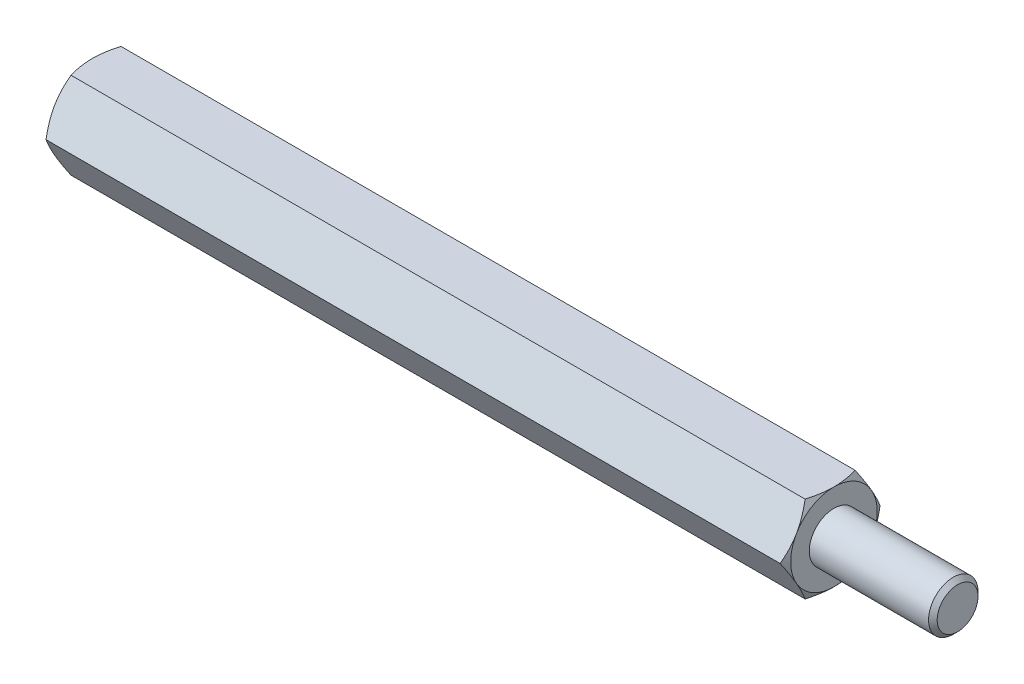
ISO-10303-21;
HEADER;
FILE_DESCRIPTION(('STEP AP214'),'2;1');
FILE_NAME('part.step','',(''),(''),'','','');
FILE_SCHEMA(('AUTOMOTIVE_DESIGN { 1 0 10303 214 1 1 1 1 }'));
ENDSEC;
DATA;
#1=APPLICATION_CONTEXT('core data for automotive mechanical design processes');
#2=APPLICATION_PROTOCOL_DEFINITION('international standard','automotive_design',2000,#1);
#3=PRODUCT_CONTEXT('',#1,'mechanical');
#4=PRODUCT('Part','Part','',(#3));
#5=PRODUCT_RELATED_PRODUCT_CATEGORY('part','',(#4));
#6=PRODUCT_DEFINITION_FORMATION('','',#4);
#7=PRODUCT_DEFINITION_CONTEXT('part definition',#1,'design');
#8=PRODUCT_DEFINITION('design','',#6,#7);
#9=PRODUCT_DEFINITION_SHAPE('','',#8);
#10=(LENGTH_UNIT() NAMED_UNIT(*) SI_UNIT(.MILLI.,.METRE.));
#11=(NAMED_UNIT(*) PLANE_ANGLE_UNIT() SI_UNIT($,.RADIAN.));
#12=(NAMED_UNIT(*) SI_UNIT($,.STERADIAN.) SOLID_ANGLE_UNIT());
#13=UNCERTAINTY_MEASURE_WITH_UNIT(LENGTH_MEASURE(1.E-05),#10,'distance_accuracy_value','');
#14=(GEOMETRIC_REPRESENTATION_CONTEXT(3) GLOBAL_UNCERTAINTY_ASSIGNED_CONTEXT((#13)) GLOBAL_UNIT_ASSIGNED_CONTEXT((#10,
#11,#12)) REPRESENTATION_CONTEXT('',''));
#15=CARTESIAN_POINT('',(0.,0.,0.));
#16=DIRECTION('',(0.,0.,1.));
#17=DIRECTION('',(1.,0.,0.));
#18=AXIS2_PLACEMENT_3D('',#15,#16,#17);
#19=CARTESIAN_POINT('',(30.,3.5,-2.02072594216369));
#20=DIRECTION('',(1.,0.,0.));
#21=DIRECTION('',(0.,0.,-1.));
#22=AXIS2_PLACEMENT_3D('',#19,#20,#21);
#23=PLANE('',#22);
#24=CARTESIAN_POINT('',(30.,0.,0.));
#25=DIRECTION('',(1.,0.,0.));
#26=DIRECTION('',(0.,0.,-1.));
#27=AXIS2_PLACEMENT_3D('',#24,#25,#26);
#28=CIRCLE('',#27,3.50000000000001);
#29=CARTESIAN_POINT('',(30.,-1.75,-3.03108891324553));
#30=VERTEX_POINT('',#29);
#31=CARTESIAN_POINT('',(30.,1.75,-3.03108891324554));
#32=VERTEX_POINT('',#31);
#33=EDGE_CURVE('E288',#30,#32,#28,.T.);
#34=ORIENTED_EDGE('',*,*,#33,.T.);
#35=CARTESIAN_POINT('',(30.,3.5,0.));
#36=VERTEX_POINT('',#35);
#37=EDGE_CURVE('E53',#32,#36,#28,.T.);
#38=ORIENTED_EDGE('',*,*,#37,.T.);
#39=CARTESIAN_POINT('',(30.,1.75,3.03108891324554));
#40=VERTEX_POINT('',#39);
#41=EDGE_CURVE('E297',#36,#40,#28,.T.);
#42=ORIENTED_EDGE('',*,*,#41,.T.);
#43=CARTESIAN_POINT('',(30.,-1.75000000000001,3.03108891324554));
#44=VERTEX_POINT('',#43);
#45=EDGE_CURVE('E302',#40,#44,#28,.T.);
#46=ORIENTED_EDGE('',*,*,#45,.T.);
#47=CARTESIAN_POINT('',(30.,0.,0.));
#48=DIRECTION('',(-1.,0.,0.));
#49=DIRECTION('',(0.,-1.,0.));
#50=AXIS2_PLACEMENT_3D('',#47,#48,#49);
#51=CIRCLE('',#50,3.50000000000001);
#52=CARTESIAN_POINT('',(30.,-3.50000000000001,0.));
#53=VERTEX_POINT('',#52);
#54=EDGE_CURVE('E193',#53,#44,#51,.T.);
#55=ORIENTED_EDGE('',*,*,#54,.F.);
#56=EDGE_CURVE('E61',#53,#30,#28,.T.);
#57=ORIENTED_EDGE('',*,*,#56,.T.);
#58=EDGE_LOOP('',(#34,#38,#42,#46,#55,#57));
#59=FACE_BOUND('',#58,.T.);
#60=CARTESIAN_POINT('',(30.,0.,0.));
#61=DIRECTION('',(1.,0.,0.));
#62=DIRECTION('',(0.,0.,-1.));
#63=AXIS2_PLACEMENT_3D('',#60,#61,#62);
#64=CIRCLE('',#63,2.);
#65=CARTESIAN_POINT('',(30.,0.,-2.));
#66=VERTEX_POINT('',#65);
#67=EDGE_CURVE('E315',#66,#66,#64,.T.);
#68=ORIENTED_EDGE('',*,*,#67,.F.);
#69=EDGE_LOOP('',(#68));
#70=FACE_BOUND('',#69,.T.);
#71=ADVANCED_FACE('F37',(#59,#70),#23,.T.);
#72=CARTESIAN_POINT('',(30.,0.,-4.04145188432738));
#73=DIRECTION('',(0.,-0.5,0.866025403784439));
#74=DIRECTION('',(0.,-0.866025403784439,-0.5));
#75=AXIS2_PLACEMENT_3D('',#72,#73,#74);
#76=PLANE('',#75);
#77=CARTESIAN_POINT('',(29.6873259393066,-0.000200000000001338,-4.04156735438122));
#78=CARTESIAN_POINT('',(29.73861421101,0.153607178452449,-3.9527667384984));
#79=CARTESIAN_POINT('',(29.7852590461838,0.308742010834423,-3.86319960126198));
#80=CARTESIAN_POINT('',(29.8666781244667,0.621698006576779,-3.68251437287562));
#81=CARTESIAN_POINT('',(29.9014235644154,0.779524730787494,-3.59139307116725));
#82=CARTESIAN_POINT('',(29.9555099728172,1.09322221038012,-3.41027974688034));
#83=CARTESIAN_POINT('',(29.9752109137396,1.24904469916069,-3.32031559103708));
#84=CARTESIAN_POINT('',(29.9987298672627,1.56142288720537,-3.13996396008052));
#85=CARTESIAN_POINT('',(30.0025673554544,1.71797745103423,-3.04957714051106));
#86=CARTESIAN_POINT('',(29.994584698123,2.01050921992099,-2.88068384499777));
#87=CARTESIAN_POINT('',(29.9847245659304,2.1465302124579,-2.80215208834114));
#88=CARTESIAN_POINT('',(29.9534735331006,2.41768602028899,-2.64560020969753));
#89=CARTESIAN_POINT('',(29.9320719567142,2.55281989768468,-2.5675806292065));
#90=CARTESIAN_POINT('',(29.8785695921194,2.82453479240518,-2.41070596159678));
#91=CARTESIAN_POINT('',(29.8462420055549,2.96108141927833,-2.33187072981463));
#92=CARTESIAN_POINT('',(29.772871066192,3.2321380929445,-2.17537608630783));
#93=CARTESIAN_POINT('',(29.7318449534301,3.36665161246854,-2.09771466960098));
#94=CARTESIAN_POINT('',(29.6873259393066,3.5002,-2.02061047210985));
#95=B_SPLINE_CURVE_WITH_KNOTS('',3,(#77,#78,#79,#80,#81,#82,#83,#84,#85,#86,#87,#88,#89,#90,#91,
#92,#93,#94),.UNSPECIFIED.,.F.,.F.,(4,2,2,2,2,2,2,2,4),(0.,0.554793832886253,1.11092123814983,
1.65328467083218,2.19498204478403,2.6666513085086,3.13875761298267,3.6213361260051,
4.10296698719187),.UNSPECIFIED.);
#96=CARTESIAN_POINT('',(29.6873926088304,0.,-4.04145188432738));
#97=VERTEX_POINT('',#96);
#98=EDGE_CURVE('E323',#97,#32,#95,.T.);
#99=ORIENTED_EDGE('',*,*,#98,.F.);
#100=DIRECTION('',(-1.,0.,0.));
#101=VECTOR('',#100,1.);
#102=CARTESIAN_POINT('',(30.,0.,-4.04145188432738));
#103=LINE('',#102,#101);
#104=CARTESIAN_POINT('',(-29.6873926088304,0.,-4.04145188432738));
#105=VERTEX_POINT('',#104);
#106=EDGE_CURVE('E264',#97,#105,#103,.T.);
#107=ORIENTED_EDGE('',*,*,#106,.T.);
#108=CARTESIAN_POINT('',(-29.6873259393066,3.5002,-2.02061047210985));
#109=CARTESIAN_POINT('',(-29.73861421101,3.34639282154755,-2.10941108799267));
#110=CARTESIAN_POINT('',(-29.7852590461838,3.19125798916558,-2.19897822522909));
#111=CARTESIAN_POINT('',(-29.8666781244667,2.87830199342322,-2.37966345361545));
#112=CARTESIAN_POINT('',(-29.9014235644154,2.7204752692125,-2.47078475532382));
#113=CARTESIAN_POINT('',(-29.9555099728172,2.40677778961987,-2.65189807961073));
#114=CARTESIAN_POINT('',(-29.9752109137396,2.25095530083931,-2.74186223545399));
#115=CARTESIAN_POINT('',(-29.9987298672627,1.93857711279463,-2.92221386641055));
#116=CARTESIAN_POINT('',(-30.0025673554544,1.78202254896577,-3.01260068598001));
#117=CARTESIAN_POINT('',(-29.994584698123,1.48949078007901,-3.1814939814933));
#118=CARTESIAN_POINT('',(-29.9847245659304,1.35346978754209,-3.26002573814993));
#119=CARTESIAN_POINT('',(-29.9534735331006,1.082313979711,-3.41657761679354));
#120=CARTESIAN_POINT('',(-29.9320719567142,0.947180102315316,-3.49459719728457));
#121=CARTESIAN_POINT('',(-29.8785695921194,0.675465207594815,-3.65147186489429));
#122=CARTESIAN_POINT('',(-29.8462420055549,0.538918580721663,-3.73030709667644));
#123=CARTESIAN_POINT('',(-29.772871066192,0.267861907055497,-3.88680174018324));
#124=CARTESIAN_POINT('',(-29.7318449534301,0.133348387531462,-3.96446315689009));
#125=CARTESIAN_POINT('',(-29.6873259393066,-0.000200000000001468,-4.04156735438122));
#126=B_SPLINE_CURVE_WITH_KNOTS('',3,(#108,#109,#110,#111,#112,#113,#114,#115,#116,#117,#118,
#119,#120,#121,#122,#123,#124,#125),.UNSPECIFIED.,.F.,.F.,(4,2,2,2,2,2,2,2,4),(0.,
0.554793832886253,1.11092123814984,1.65328467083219,2.19498204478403,2.6666513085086,
3.13875761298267,3.6213361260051,4.10296698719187),.UNSPECIFIED.);
#127=CARTESIAN_POINT('',(-30.,1.75,-3.03108891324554));
#128=VERTEX_POINT('',#127);
#129=EDGE_CURVE('E417',#128,#105,#126,.T.);
#130=ORIENTED_EDGE('',*,*,#129,.F.);
#131=CARTESIAN_POINT('',(-29.6873926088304,3.5,-2.02072594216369));
#132=VERTEX_POINT('',#131);
#133=EDGE_CURVE('E416',#132,#128,#126,.T.);
#134=ORIENTED_EDGE('',*,*,#133,.F.);
#135=DIRECTION('',(-1.,0.,0.));
#136=VECTOR('',#135,1.);
#137=CARTESIAN_POINT('',(30.,3.5,-2.02072594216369));
#138=LINE('',#137,#136);
#139=CARTESIAN_POINT('',(29.6873926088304,3.5,-2.02072594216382));
#140=VERTEX_POINT('',#139);
#141=EDGE_CURVE('E279',#140,#132,#138,.T.);
#142=ORIENTED_EDGE('',*,*,#141,.F.);
#143=EDGE_CURVE('E229',#32,#140,#95,.T.);
#144=ORIENTED_EDGE('',*,*,#143,.F.);
#145=EDGE_LOOP('',(#99,#107,#130,#134,#142,#144));
#146=FACE_BOUND('',#145,.T.);
#147=ADVANCED_FACE('F148',(#146),#76,.F.);
#148=CARTESIAN_POINT('',(30.,3.5,-2.02072594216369));
#149=DIRECTION('',(0.,-1.,0.));
#150=DIRECTION('',(0.,0.,-1.));
#151=AXIS2_PLACEMENT_3D('',#148,#149,#150);
#152=PLANE('',#151);
#153=CARTESIAN_POINT('',(28.2443294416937,3.5,-5.525713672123));
#154=CARTESIAN_POINT('',(28.3192813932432,3.5,-5.3720019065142));
#155=CARTESIAN_POINT('',(28.3935424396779,3.5,-5.21794762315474));
#156=CARTESIAN_POINT('',(28.5402960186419,3.5,-4.90897223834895));
#157=CARTESIAN_POINT('',(28.6127882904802,3.5,-4.75405101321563));
#158=CARTESIAN_POINT('',(28.7559617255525,3.5,-4.44240758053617));
#159=CARTESIAN_POINT('',(28.8266316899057,3.5,-4.28568021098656));
#160=CARTESIAN_POINT('',(28.9652074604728,3.5,-3.97101270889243));
#161=CARTESIAN_POINT('',(29.0331133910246,3.5,-3.81307263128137));
#162=CARTESIAN_POINT('',(29.1677143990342,3.5,-3.49026114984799));
#163=CARTESIAN_POINT('',(29.2342871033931,3.5,-3.32533845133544));
#164=CARTESIAN_POINT('',(29.3626267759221,3.5,-2.99359992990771));
#165=CARTESIAN_POINT('',(29.4243932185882,3.5,-2.82678390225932));
#166=CARTESIAN_POINT('',(29.5415700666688,3.5,-2.49127529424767));
#167=CARTESIAN_POINT('',(29.5969925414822,3.5,-2.32258697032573));
#168=CARTESIAN_POINT('',(29.6997679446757,3.5,-1.98279215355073));
#169=CARTESIAN_POINT('',(29.7471233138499,3.5,-1.81168640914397));
#170=CARTESIAN_POINT('',(29.8312987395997,3.5,-1.46793354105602));
#171=CARTESIAN_POINT('',(29.8681796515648,3.5,-1.2953015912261));
#172=CARTESIAN_POINT('',(29.9293955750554,3.5,-0.947791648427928));
#173=CARTESIAN_POINT('',(29.953731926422,3.5,-0.772913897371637));
#174=CARTESIAN_POINT('',(29.9876038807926,3.5,-0.424108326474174));
#175=CARTESIAN_POINT('',(29.997337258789,3.5,-0.250200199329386));
#176=CARTESIAN_POINT('',(30.0017053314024,3.5,0.0978233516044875));
#177=CARTESIAN_POINT('',(29.9963399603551,3.5,0.271938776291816));
#178=CARTESIAN_POINT('',(29.9750118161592,3.5,0.564711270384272));
#179=CARTESIAN_POINT('',(29.9628919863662,3.5,0.683667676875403));
#180=CARTESIAN_POINT('',(29.9323080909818,3.5,0.920767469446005));
#181=CARTESIAN_POINT('',(29.9138432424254,3.5,1.03891075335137));
#182=CARTESIAN_POINT('',(29.8498956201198,3.5,1.39193174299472));
#183=CARTESIAN_POINT('',(29.7958695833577,3.5,1.62528232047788));
#184=CARTESIAN_POINT('',(29.7014515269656,3.5,1.97433825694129));
#185=CARTESIAN_POINT('',(29.6672900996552,3.5,2.09183268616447));
#186=CARTESIAN_POINT('',(29.595234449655,3.5,2.32568238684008));
#187=CARTESIAN_POINT('',(29.5573401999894,3.5,2.44203765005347));
#188=CARTESIAN_POINT('',(29.4784421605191,3.5,2.6736423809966));
#189=CARTESIAN_POINT('',(29.4374392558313,3.5,2.78889215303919));
#190=CARTESIAN_POINT('',(29.352824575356,3.5,3.01842460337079));
#191=CARTESIAN_POINT('',(29.3092128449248,3.5,3.1327072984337));
#192=CARTESIAN_POINT('',(29.1958241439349,3.5,3.42150510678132));
#193=CARTESIAN_POINT('',(29.1245636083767,3.5,3.59543696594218));
#194=CARTESIAN_POINT('',(28.9781026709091,3.5,3.94163961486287));
#195=CARTESIAN_POINT('',(28.9029019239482,3.5,4.11391025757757));
#196=CARTESIAN_POINT('',(28.7494252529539,3.5,4.45713072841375));
#197=CARTESIAN_POINT('',(28.6711484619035,3.5,4.62808016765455));
#198=CARTESIAN_POINT('',(28.512188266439,3.5,4.9688584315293));
#199=CARTESIAN_POINT('',(28.4315047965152,3.5,5.13868722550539));
#200=CARTESIAN_POINT('',(28.1863871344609,3.5,5.64726192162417));
#201=CARTESIAN_POINT('',(28.0190975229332,3.5,5.98463020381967));
#202=CARTESIAN_POINT('',(27.6795854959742,3.5,6.65678495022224));
#203=CARTESIAN_POINT('',(27.5073639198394,3.5,6.99157184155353));
#204=CARTESIAN_POINT('',(27.1760800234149,3.5,7.62749570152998));
#205=CARTESIAN_POINT('',(27.0173299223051,3.5,7.92879562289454));
#206=CARTESIAN_POINT('',(26.6977473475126,3.5,8.53030635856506));
#207=CARTESIAN_POINT('',(26.5369147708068,3.5,8.83051711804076));
#208=CARTESIAN_POINT('',(26.2141792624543,3.5,9.42918006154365));
#209=CARTESIAN_POINT('',(26.0522810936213,3.5,9.72763481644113));
#210=CARTESIAN_POINT('',(25.7272737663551,3.5,10.3238577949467));
#211=CARTESIAN_POINT('',(25.5641646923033,3.5,10.6216260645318));
#212=CARTESIAN_POINT('',(25.4006104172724,3.5,10.9191478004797));
#213=B_SPLINE_CURVE_WITH_KNOTS('',3,(#153,#154,#155,#156,#157,#158,#159,#160,#161,#162,#163,
#164,#165,#166,#167,#168,#169,#170,#171,#172,#173,#174,#175,#176,#177,#178,#179,#180,#181,#182,
#183,#184,#185,#186,#187,#188,#189,#190,#191,#192,#193,#194,#195,#196,#197,#198,#199,#200,#201,
#202,#203,#204,#205,#206,#207,#208,#209,#210,#211,#212),.UNSPECIFIED.,.F.,.F.,(4,2,2,2,2,2,2,2,
2,2,2,2,2,2,2,2,2,2,2,2,2,2,2,2,2,2,2,2,2,4),(0.,0.513041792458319,1.02615874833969,
1.54190801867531,2.05763406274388,2.59113284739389,3.12468988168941,3.65721433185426,
4.18957737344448,4.71878103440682,5.24792816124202,5.76984197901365,6.29175806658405,
6.6503025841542,7.00889136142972,7.72642330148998,8.09346920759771,8.46051776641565,
8.82746220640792,9.19440026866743,9.75822236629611,10.3220939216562,10.8861255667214,
11.4501725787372,12.579801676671,13.7092396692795,14.730918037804,15.7526471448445,
16.771258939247,17.7898004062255),.UNSPECIFIED.);
#214=EDGE_CURVE('E227',#140,#36,#213,.T.);
#215=ORIENTED_EDGE('',*,*,#214,.F.);
#216=ORIENTED_EDGE('',*,*,#141,.T.);
#217=CARTESIAN_POINT('',(-28.2443294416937,3.5,-5.525713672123));
#218=CARTESIAN_POINT('',(-28.3192813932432,3.5,-5.3720019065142));
#219=CARTESIAN_POINT('',(-28.3935424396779,3.5,-5.21794762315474));
#220=CARTESIAN_POINT('',(-28.5402960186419,3.5,-4.90897223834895));
#221=CARTESIAN_POINT('',(-28.6127882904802,3.5,-4.75405101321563));
#222=CARTESIAN_POINT('',(-28.7559617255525,3.5,-4.44240758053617));
#223=CARTESIAN_POINT('',(-28.8266316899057,3.5,-4.28568021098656));
#224=CARTESIAN_POINT('',(-28.9652074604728,3.5,-3.97101270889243));
#225=CARTESIAN_POINT('',(-29.0331133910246,3.5,-3.81307263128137));
#226=CARTESIAN_POINT('',(-29.1677143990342,3.5,-3.49026114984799));
#227=CARTESIAN_POINT('',(-29.2342871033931,3.5,-3.32533845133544));
#228=CARTESIAN_POINT('',(-29.3626267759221,3.5,-2.99359992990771));
#229=CARTESIAN_POINT('',(-29.4243932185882,3.5,-2.82678390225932));
#230=CARTESIAN_POINT('',(-29.5415700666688,3.5,-2.49127529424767));
#231=CARTESIAN_POINT('',(-29.5969925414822,3.5,-2.32258697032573));
#232=CARTESIAN_POINT('',(-29.6997679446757,3.5,-1.98279215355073));
#233=CARTESIAN_POINT('',(-29.7471233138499,3.5,-1.81168640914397));
#234=CARTESIAN_POINT('',(-29.8312987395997,3.5,-1.46793354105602));
#235=CARTESIAN_POINT('',(-29.8681796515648,3.5,-1.2953015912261));
#236=CARTESIAN_POINT('',(-29.9293955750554,3.5,-0.947791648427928));
#237=CARTESIAN_POINT('',(-29.953731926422,3.5,-0.772913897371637));
#238=CARTESIAN_POINT('',(-29.9876038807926,3.5,-0.424108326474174));
#239=CARTESIAN_POINT('',(-29.997337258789,3.5,-0.250200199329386));
#240=CARTESIAN_POINT('',(-30.0017053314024,3.5,0.0978233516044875));
#241=CARTESIAN_POINT('',(-29.9963399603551,3.5,0.271938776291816));
#242=CARTESIAN_POINT('',(-29.9750118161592,3.5,0.564711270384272));
#243=CARTESIAN_POINT('',(-29.9628919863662,3.5,0.683667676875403));
#244=CARTESIAN_POINT('',(-29.9323080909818,3.5,0.920767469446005));
#245=CARTESIAN_POINT('',(-29.9138432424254,3.5,1.03891075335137));
#246=CARTESIAN_POINT('',(-29.8498956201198,3.5,1.39193174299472));
#247=CARTESIAN_POINT('',(-29.7958695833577,3.5,1.62528232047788));
#248=CARTESIAN_POINT('',(-29.7014515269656,3.5,1.97433825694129));
#249=CARTESIAN_POINT('',(-29.6672900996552,3.5,2.09183268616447));
#250=CARTESIAN_POINT('',(-29.595234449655,3.5,2.32568238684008));
#251=CARTESIAN_POINT('',(-29.5573401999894,3.5,2.44203765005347));
#252=CARTESIAN_POINT('',(-29.4784421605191,3.5,2.6736423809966));
#253=CARTESIAN_POINT('',(-29.4374392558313,3.5,2.78889215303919));
#254=CARTESIAN_POINT('',(-29.352824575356,3.5,3.01842460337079));
#255=CARTESIAN_POINT('',(-29.3092128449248,3.5,3.1327072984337));
#256=CARTESIAN_POINT('',(-29.1958241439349,3.5,3.42150510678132));
#257=CARTESIAN_POINT('',(-29.1245636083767,3.5,3.59543696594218));
#258=CARTESIAN_POINT('',(-28.9781026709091,3.5,3.94163961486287));
#259=CARTESIAN_POINT('',(-28.9029019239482,3.5,4.11391025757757));
#260=CARTESIAN_POINT('',(-28.7494252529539,3.5,4.45713072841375));
#261=CARTESIAN_POINT('',(-28.6711484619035,3.5,4.62808016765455));
#262=CARTESIAN_POINT('',(-28.512188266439,3.5,4.9688584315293));
#263=CARTESIAN_POINT('',(-28.4315047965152,3.5,5.13868722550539));
#264=CARTESIAN_POINT('',(-28.1863871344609,3.5,5.64726192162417));
#265=CARTESIAN_POINT('',(-28.0190975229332,3.5,5.98463020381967));
#266=CARTESIAN_POINT('',(-27.6795854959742,3.5,6.65678495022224));
#267=CARTESIAN_POINT('',(-27.5073639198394,3.5,6.99157184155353));
#268=CARTESIAN_POINT('',(-27.1760800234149,3.5,7.62749570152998));
#269=CARTESIAN_POINT('',(-27.0173299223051,3.5,7.92879562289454));
#270=CARTESIAN_POINT('',(-26.6977473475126,3.5,8.53030635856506));
#271=CARTESIAN_POINT('',(-26.5369147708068,3.5,8.83051711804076));
#272=CARTESIAN_POINT('',(-26.2141792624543,3.5,9.42918006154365));
#273=CARTESIAN_POINT('',(-26.0522810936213,3.5,9.72763481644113));
#274=CARTESIAN_POINT('',(-25.7272737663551,3.5,10.3238577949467));
#275=CARTESIAN_POINT('',(-25.5641646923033,3.5,10.6216260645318));
#276=CARTESIAN_POINT('',(-25.4006104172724,3.5,10.9191478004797));
#277=B_SPLINE_CURVE_WITH_KNOTS('',3,(#217,#218,#219,#220,#221,#222,#223,#224,#225,#226,#227,
#228,#229,#230,#231,#232,#233,#234,#235,#236,#237,#238,#239,#240,#241,#242,#243,#244,#245,#246,
#247,#248,#249,#250,#251,#252,#253,#254,#255,#256,#257,#258,#259,#260,#261,#262,#263,#264,#265,
#266,#267,#268,#269,#270,#271,#272,#273,#274,#275,#276),.UNSPECIFIED.,.F.,.F.,(4,2,2,2,2,2,2,2,
2,2,2,2,2,2,2,2,2,2,2,2,2,2,2,2,2,2,2,2,2,4),(0.,0.513041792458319,1.02615874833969,
1.54190801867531,2.05763406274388,2.59113284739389,3.12468988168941,3.65721433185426,
4.18957737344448,4.71878103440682,5.24792816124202,5.76984197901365,6.29175806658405,
6.6503025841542,7.00889136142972,7.72642330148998,8.09346920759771,8.46051776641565,
8.82746220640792,9.19440026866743,9.75822236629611,10.3220939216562,10.8861255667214,
11.4501725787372,12.579801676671,13.7092396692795,14.730918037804,15.7526471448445,
16.771258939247,17.7898004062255),.UNSPECIFIED.);
#278=CARTESIAN_POINT('',(-30.,3.5,0.));
#279=VERTEX_POINT('',#278);
#280=EDGE_CURVE('E241',#279,#132,#277,.F.);
#281=ORIENTED_EDGE('',*,*,#280,.F.);
#282=CARTESIAN_POINT('',(-29.6873926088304,3.5,2.02072594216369));
#283=VERTEX_POINT('',#282);
#284=EDGE_CURVE('E249',#283,#279,#277,.F.);
#285=ORIENTED_EDGE('',*,*,#284,.F.);
#286=DIRECTION('',(-1.,0.,0.));
#287=VECTOR('',#286,1.);
#288=CARTESIAN_POINT('',(30.,3.5,2.02072594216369));
#289=LINE('',#288,#287);
#290=CARTESIAN_POINT('',(29.6873926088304,3.5,2.02072594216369));
#291=VERTEX_POINT('',#290);
#292=EDGE_CURVE('E276',#291,#283,#289,.T.);
#293=ORIENTED_EDGE('',*,*,#292,.F.);
#294=EDGE_CURVE('E221',#36,#291,#213,.T.);
#295=ORIENTED_EDGE('',*,*,#294,.F.);
#296=EDGE_LOOP('',(#215,#216,#281,#285,#293,#295));
#297=FACE_BOUND('',#296,.T.);
#298=ADVANCED_FACE('F153',(#297),#152,.F.);
#299=CARTESIAN_POINT('',(30.,3.5,2.02072594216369));
#300=DIRECTION('',(0.,-0.5,-0.866025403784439));
#301=DIRECTION('',(0.,0.866025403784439,-0.5));
#302=AXIS2_PLACEMENT_3D('',#299,#300,#301);
#303=PLANE('',#302);
#304=CARTESIAN_POINT('',(29.6873259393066,3.5002,2.02061047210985));
#305=CARTESIAN_POINT('',(29.73861421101,3.34639282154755,2.10941108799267));
#306=CARTESIAN_POINT('',(29.7852590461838,3.19125798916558,2.19897822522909));
#307=CARTESIAN_POINT('',(29.8666781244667,2.87830199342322,2.37966345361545));
#308=CARTESIAN_POINT('',(29.9014235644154,2.7204752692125,2.47078475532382));
#309=CARTESIAN_POINT('',(29.9555099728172,2.40677778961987,2.65189807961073));
#310=CARTESIAN_POINT('',(29.9752109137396,2.25095530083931,2.74186223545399));
#311=CARTESIAN_POINT('',(29.9987298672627,1.93857711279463,2.92221386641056));
#312=CARTESIAN_POINT('',(30.0025673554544,1.78202254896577,3.01260068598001));
#313=CARTESIAN_POINT('',(29.994584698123,1.48949078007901,3.1814939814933));
#314=CARTESIAN_POINT('',(29.9847245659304,1.35346978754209,3.26002573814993));
#315=CARTESIAN_POINT('',(29.9534735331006,1.082313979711,3.41657761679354));
#316=CARTESIAN_POINT('',(29.9320719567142,0.947180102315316,3.49459719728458));
#317=CARTESIAN_POINT('',(29.8785695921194,0.675465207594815,3.65147186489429));
#318=CARTESIAN_POINT('',(29.8462420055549,0.538918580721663,3.73030709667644));
#319=CARTESIAN_POINT('',(29.772871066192,0.267861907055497,3.88680174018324));
#320=CARTESIAN_POINT('',(29.7318449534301,0.133348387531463,3.96446315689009));
#321=CARTESIAN_POINT('',(29.6873259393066,-0.000200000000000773,4.04156735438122));
#322=B_SPLINE_CURVE_WITH_KNOTS('',3,(#304,#305,#306,#307,#308,#309,#310,#311,#312,#313,#314,
#315,#316,#317,#318,#319,#320,#321),.UNSPECIFIED.,.F.,.F.,(4,2,2,2,2,2,2,2,4),(0.,
0.554793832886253,1.11092123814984,1.65328467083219,2.19498204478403,2.6666513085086,
3.13875761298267,3.6213361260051,4.10296698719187),.UNSPECIFIED.);
#323=EDGE_CURVE('E228',#291,#40,#322,.T.);
#324=ORIENTED_EDGE('',*,*,#323,.F.);
#325=ORIENTED_EDGE('',*,*,#292,.T.);
#326=CARTESIAN_POINT('',(-29.6873259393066,-0.00020000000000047,4.04156735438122));
#327=CARTESIAN_POINT('',(-29.73861421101,0.153607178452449,3.9527667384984));
#328=CARTESIAN_POINT('',(-29.7852590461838,0.308742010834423,3.86319960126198));
#329=CARTESIAN_POINT('',(-29.8666781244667,0.62169800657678,3.68251437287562));
#330=CARTESIAN_POINT('',(-29.9014235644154,0.779524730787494,3.59139307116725));
#331=CARTESIAN_POINT('',(-29.9555099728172,1.09322221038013,3.41027974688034));
#332=CARTESIAN_POINT('',(-29.9752109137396,1.24904469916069,3.32031559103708));
#333=CARTESIAN_POINT('',(-29.9987298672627,1.56142288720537,3.13996396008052));
#334=CARTESIAN_POINT('',(-30.0025673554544,1.71797745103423,3.04957714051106));
#335=CARTESIAN_POINT('',(-29.994584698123,2.01050921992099,2.88068384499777));
#336=CARTESIAN_POINT('',(-29.9847245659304,2.1465302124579,2.80215208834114));
#337=CARTESIAN_POINT('',(-29.9534735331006,2.41768602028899,2.64560020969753));
#338=CARTESIAN_POINT('',(-29.9320719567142,2.55281989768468,2.5675806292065));
#339=CARTESIAN_POINT('',(-29.8785695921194,2.82453479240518,2.41070596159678));
#340=CARTESIAN_POINT('',(-29.8462420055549,2.96108141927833,2.33187072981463));
#341=CARTESIAN_POINT('',(-29.772871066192,3.2321380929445,2.17537608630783));
#342=CARTESIAN_POINT('',(-29.7318449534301,3.36665161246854,2.09771466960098));
#343=CARTESIAN_POINT('',(-29.6873259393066,3.5002,2.02061047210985));
#344=B_SPLINE_CURVE_WITH_KNOTS('',3,(#326,#327,#328,#329,#330,#331,#332,#333,#334,#335,#336,
#337,#338,#339,#340,#341,#342,#343),.UNSPECIFIED.,.F.,.F.,(4,2,2,2,2,2,2,2,4),(0.,
0.554793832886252,1.11092123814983,1.65328467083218,2.19498204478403,2.6666513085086,
3.13875761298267,3.62133612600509,4.10296698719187),.UNSPECIFIED.);
#345=CARTESIAN_POINT('',(-30.,1.75,3.03108891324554));
#346=VERTEX_POINT('',#345);
#347=EDGE_CURVE('E255',#346,#283,#344,.T.);
#348=ORIENTED_EDGE('',*,*,#347,.F.);
#349=CARTESIAN_POINT('',(-29.6873926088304,0.,4.04145188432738));
#350=VERTEX_POINT('',#349);
#351=EDGE_CURVE('E262',#350,#346,#344,.T.);
#352=ORIENTED_EDGE('',*,*,#351,.F.);
#353=DIRECTION('',(-1.,0.,0.));
#354=VECTOR('',#353,1.);
#355=CARTESIAN_POINT('',(30.,0.,4.04145188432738));
#356=LINE('',#355,#354);
#357=CARTESIAN_POINT('',(29.6873926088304,0.,4.04145188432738));
#358=VERTEX_POINT('',#357);
#359=EDGE_CURVE('E273',#358,#350,#356,.T.);
#360=ORIENTED_EDGE('',*,*,#359,.F.);
#361=EDGE_CURVE('E215',#40,#358,#322,.T.);
#362=ORIENTED_EDGE('',*,*,#361,.F.);
#363=EDGE_LOOP('',(#324,#325,#348,#352,#360,#362));
#364=FACE_BOUND('',#363,.T.);
#365=ADVANCED_FACE('F235',(#364),#303,.F.);
#366=CARTESIAN_POINT('',(30.,0.,4.04145188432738));
#367=DIRECTION('',(0.,0.5,-0.866025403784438));
#368=DIRECTION('',(0.,0.866025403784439,0.5));
#369=AXIS2_PLACEMENT_3D('',#366,#367,#368);
#370=PLANE('',#369);
#371=CARTESIAN_POINT('',(29.6873259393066,0.000199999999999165,4.04156735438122));
#372=CARTESIAN_POINT('',(29.73861421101,-0.153607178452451,3.9527667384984));
#373=CARTESIAN_POINT('',(29.7852590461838,-0.308742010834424,3.86319960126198));
#374=CARTESIAN_POINT('',(29.8666781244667,-0.621698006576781,3.68251437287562));
#375=CARTESIAN_POINT('',(29.9014235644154,-0.779524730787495,3.59139307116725));
#376=CARTESIAN_POINT('',(29.9555099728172,-1.09322221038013,3.41027974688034));
#377=CARTESIAN_POINT('',(29.9752109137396,-1.24904469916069,3.32031559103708));
#378=CARTESIAN_POINT('',(29.9987298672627,-1.56142288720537,3.13996396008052));
#379=CARTESIAN_POINT('',(30.0025673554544,-1.71797745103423,3.04957714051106));
#380=CARTESIAN_POINT('',(29.994584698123,-2.01050921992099,2.88068384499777));
#381=CARTESIAN_POINT('',(29.9847245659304,-2.1465302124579,2.80215208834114));
#382=CARTESIAN_POINT('',(29.9534735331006,-2.41768602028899,2.64560020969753));
#383=CARTESIAN_POINT('',(29.9320719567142,-2.55281989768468,2.5675806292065));
#384=CARTESIAN_POINT('',(29.8785695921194,-2.82453479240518,2.41070596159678));
#385=CARTESIAN_POINT('',(29.8462420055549,-2.96108141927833,2.33187072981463));
#386=CARTESIAN_POINT('',(29.772871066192,-3.2321380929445,2.17537608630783));
#387=CARTESIAN_POINT('',(29.7318449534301,-3.36665161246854,2.09771466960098));
#388=CARTESIAN_POINT('',(29.6873259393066,-3.5002,2.02061047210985));
#389=B_SPLINE_CURVE_WITH_KNOTS('',3,(#371,#372,#373,#374,#375,#376,#377,#378,#379,#380,#381,
#382,#383,#384,#385,#386,#387,#388),.UNSPECIFIED.,.F.,.F.,(4,2,2,2,2,2,2,2,4),(0.,
0.554793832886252,1.11092123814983,1.65328467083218,2.19498204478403,2.6666513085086,
3.13875761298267,3.62133612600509,4.10296698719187),.UNSPECIFIED.);
#390=EDGE_CURVE('E326',#358,#44,#389,.T.);
#391=ORIENTED_EDGE('',*,*,#390,.F.);
#392=ORIENTED_EDGE('',*,*,#359,.T.);
#393=CARTESIAN_POINT('',(-29.6873259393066,-3.5002,2.02061047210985));
#394=CARTESIAN_POINT('',(-29.73861421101,-3.34639282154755,2.10941108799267));
#395=CARTESIAN_POINT('',(-29.7852590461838,-3.19125798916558,2.19897822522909));
#396=CARTESIAN_POINT('',(-29.8666781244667,-2.87830199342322,2.37966345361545));
#397=CARTESIAN_POINT('',(-29.9014235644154,-2.72047526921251,2.47078475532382));
#398=CARTESIAN_POINT('',(-29.9555099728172,-2.40677778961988,2.65189807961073));
#399=CARTESIAN_POINT('',(-29.9752109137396,-2.25095530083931,2.74186223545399));
#400=CARTESIAN_POINT('',(-29.9987298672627,-1.93857711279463,2.92221386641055));
#401=CARTESIAN_POINT('',(-30.0025673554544,-1.78202254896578,3.01260068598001));
#402=CARTESIAN_POINT('',(-29.994584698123,-1.48949078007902,3.18149398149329));
#403=CARTESIAN_POINT('',(-29.9847245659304,-1.3534697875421,3.26002573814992));
#404=CARTESIAN_POINT('',(-29.9534735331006,-1.08231397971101,3.41657761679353));
#405=CARTESIAN_POINT('',(-29.9320719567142,-0.947180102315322,3.49459719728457));
#406=CARTESIAN_POINT('',(-29.8785695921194,-0.67546520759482,3.65147186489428));
#407=CARTESIAN_POINT('',(-29.8462420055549,-0.538918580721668,3.73030709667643));
#408=CARTESIAN_POINT('',(-29.772871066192,-0.2678619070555,3.88680174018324));
#409=CARTESIAN_POINT('',(-29.7318449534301,-0.133348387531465,3.96446315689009));
#410=CARTESIAN_POINT('',(-29.6873259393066,0.000199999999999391,4.04156735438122));
#411=B_SPLINE_CURVE_WITH_KNOTS('',3,(#393,#394,#395,#396,#397,#398,#399,#400,#401,#402,#403,
#404,#405,#406,#407,#408,#409,#410),.UNSPECIFIED.,.F.,.F.,(4,2,2,2,2,2,2,2,4),(0.,
0.554793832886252,1.11092123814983,1.65328467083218,2.19498204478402,2.66665130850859,
3.13875761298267,3.62133612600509,4.10296698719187),.UNSPECIFIED.);
#412=CARTESIAN_POINT('',(-30.,-1.75000000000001,3.03108891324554));
#413=VERTEX_POINT('',#412);
#414=EDGE_CURVE('E263',#413,#350,#411,.T.);
#415=ORIENTED_EDGE('',*,*,#414,.F.);
#416=CARTESIAN_POINT('',(-29.6873926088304,-3.5,2.02072594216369));
#417=VERTEX_POINT('',#416);
#418=EDGE_CURVE('E250',#417,#413,#411,.T.);
#419=ORIENTED_EDGE('',*,*,#418,.F.);
#420=DIRECTION('',(-1.,0.,0.));
#421=VECTOR('',#420,1.);
#422=CARTESIAN_POINT('',(30.,-3.5,2.02072594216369));
#423=LINE('',#422,#421);
#424=CARTESIAN_POINT('',(29.6873926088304,-3.5,2.02072594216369));
#425=VERTEX_POINT('',#424);
#426=EDGE_CURVE('E270',#425,#417,#423,.T.);
#427=ORIENTED_EDGE('',*,*,#426,.F.);
#428=EDGE_CURVE('E210',#44,#425,#389,.T.);
#429=ORIENTED_EDGE('',*,*,#428,.F.);
#430=EDGE_LOOP('',(#391,#392,#415,#419,#427,#429));
#431=FACE_BOUND('',#430,.T.);
#432=ADVANCED_FACE('F334',(#431),#370,.F.);
#433=CARTESIAN_POINT('',(30.,-3.5,2.02072594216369));
#434=DIRECTION('',(0.,1.,0.));
#435=DIRECTION('',(0.,0.,1.));
#436=AXIS2_PLACEMENT_3D('',#433,#434,#435);
#437=PLANE('',#436);
#438=CARTESIAN_POINT('',(28.2443294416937,-3.5,-5.52571367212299));
#439=CARTESIAN_POINT('',(28.3192813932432,-3.5,-5.37200190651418));
#440=CARTESIAN_POINT('',(28.393542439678,-3.5,-5.21794762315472));
#441=CARTESIAN_POINT('',(28.5402960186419,-3.5,-4.90897223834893));
#442=CARTESIAN_POINT('',(28.6127882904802,-3.5,-4.75405101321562));
#443=CARTESIAN_POINT('',(28.7559617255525,-3.5,-4.44240758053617));
#444=CARTESIAN_POINT('',(28.8266316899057,-3.5,-4.28568021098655));
#445=CARTESIAN_POINT('',(28.9652074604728,-3.5,-3.97101270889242));
#446=CARTESIAN_POINT('',(29.0331133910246,-3.5,-3.81307263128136));
#447=CARTESIAN_POINT('',(29.1677143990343,-3.5,-3.49026114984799));
#448=CARTESIAN_POINT('',(29.2342871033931,-3.5,-3.32533845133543));
#449=CARTESIAN_POINT('',(29.3626267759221,-3.5,-2.99359992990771));
#450=CARTESIAN_POINT('',(29.4243932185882,-3.5,-2.82678390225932));
#451=CARTESIAN_POINT('',(29.5415700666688,-3.5,-2.49127529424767));
#452=CARTESIAN_POINT('',(29.5969925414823,-3.5,-2.32258697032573));
#453=CARTESIAN_POINT('',(29.6997679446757,-3.5,-1.98279215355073));
#454=CARTESIAN_POINT('',(29.7471233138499,-3.5,-1.81168640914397));
#455=CARTESIAN_POINT('',(29.8312987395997,-3.5,-1.46793354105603));
#456=CARTESIAN_POINT('',(29.8681796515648,-3.5,-1.29530159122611));
#457=CARTESIAN_POINT('',(29.9293955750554,-3.5,-0.947791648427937));
#458=CARTESIAN_POINT('',(29.953731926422,-3.5,-0.772913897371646));
#459=CARTESIAN_POINT('',(29.9876038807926,-3.5,-0.424108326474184));
#460=CARTESIAN_POINT('',(29.997337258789,-3.5,-0.250200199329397));
#461=CARTESIAN_POINT('',(30.0017053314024,-3.5,0.0978233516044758));
#462=CARTESIAN_POINT('',(29.9963399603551,-3.5,0.271938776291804));
#463=CARTESIAN_POINT('',(29.9750118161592,-3.5,0.564711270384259));
#464=CARTESIAN_POINT('',(29.9628919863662,-3.5,0.683667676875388));
#465=CARTESIAN_POINT('',(29.9323080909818,-3.5,0.920767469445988));
#466=CARTESIAN_POINT('',(29.9138432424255,-3.5,1.03891075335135));
#467=CARTESIAN_POINT('',(29.8498956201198,-3.5,1.3919317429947));
#468=CARTESIAN_POINT('',(29.7958695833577,-3.5,1.62528232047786));
#469=CARTESIAN_POINT('',(29.7014515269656,-3.5,1.97433825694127));
#470=CARTESIAN_POINT('',(29.6672900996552,-3.5,2.09183268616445));
#471=CARTESIAN_POINT('',(29.5952344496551,-3.5,2.32568238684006));
#472=CARTESIAN_POINT('',(29.5573401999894,-3.5,2.44203765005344));
#473=CARTESIAN_POINT('',(29.4784421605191,-3.5,2.67364238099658));
#474=CARTESIAN_POINT('',(29.4374392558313,-3.5,2.78889215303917));
#475=CARTESIAN_POINT('',(29.352824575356,-3.5,3.01842460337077));
#476=CARTESIAN_POINT('',(29.3092128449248,-3.5,3.13270729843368));
#477=CARTESIAN_POINT('',(29.1958241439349,-3.5,3.4215051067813));
#478=CARTESIAN_POINT('',(29.1245636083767,-3.5,3.59543696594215));
#479=CARTESIAN_POINT('',(28.9781026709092,-3.5,3.94163961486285));
#480=CARTESIAN_POINT('',(28.9029019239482,-3.5,4.11391025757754));
#481=CARTESIAN_POINT('',(28.7494252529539,-3.5,4.45713072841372));
#482=CARTESIAN_POINT('',(28.6711484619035,-3.5,4.62808016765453));
#483=CARTESIAN_POINT('',(28.5121882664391,-3.5,4.96885843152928));
#484=CARTESIAN_POINT('',(28.4315047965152,-3.5,5.13868722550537));
#485=CARTESIAN_POINT('',(28.186387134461,-3.5,5.64726192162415));
#486=CARTESIAN_POINT('',(28.0190975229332,-3.5,5.98463020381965));
#487=CARTESIAN_POINT('',(27.6795854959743,-3.5,6.65678495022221));
#488=CARTESIAN_POINT('',(27.5073639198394,-3.5,6.99157184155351));
#489=CARTESIAN_POINT('',(27.1760800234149,-3.5,7.62749570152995));
#490=CARTESIAN_POINT('',(27.0173299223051,-3.5,7.92879562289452));
#491=CARTESIAN_POINT('',(26.6977473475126,-3.5,8.53030635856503));
#492=CARTESIAN_POINT('',(26.5369147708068,-3.5,8.83051711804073));
#493=CARTESIAN_POINT('',(26.2141792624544,-3.5,9.42918006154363));
#494=CARTESIAN_POINT('',(26.0522810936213,-3.5,9.72763481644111));
#495=CARTESIAN_POINT('',(25.7272737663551,-3.5,10.3238577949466));
#496=CARTESIAN_POINT('',(25.5641646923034,-3.5,10.6216260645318));
#497=CARTESIAN_POINT('',(25.4006104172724,-3.5,10.9191478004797));
#498=B_SPLINE_CURVE_WITH_KNOTS('',3,(#438,#439,#440,#441,#442,#443,#444,#445,#446,#447,#448,
#449,#450,#451,#452,#453,#454,#455,#456,#457,#458,#459,#460,#461,#462,#463,#464,#465,#466,#467,
#468,#469,#470,#471,#472,#473,#474,#475,#476,#477,#478,#479,#480,#481,#482,#483,#484,#485,#486,
#487,#488,#489,#490,#491,#492,#493,#494,#495,#496,#497),.UNSPECIFIED.,.F.,.F.,(4,2,2,2,2,2,2,2,
2,2,2,2,2,2,2,2,2,2,2,2,2,2,2,2,2,2,2,2,2,4),(0.,0.513041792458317,1.02615874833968,
1.5419080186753,2.05763406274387,2.59113284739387,3.12468988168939,3.65721433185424,
4.18957737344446,4.7187810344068,5.24792816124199,5.76984197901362,6.29175806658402,
6.65030258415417,7.00889136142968,7.72642330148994,8.09346920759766,8.46051776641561,
8.82746220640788,9.19440026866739,9.75822236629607,10.3220939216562,10.8861255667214,
11.4501725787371,12.579801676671,13.7092396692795,14.730918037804,15.7526471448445,
16.7712589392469,17.7898004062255),.UNSPECIFIED.);
#499=EDGE_CURVE('E404',#425,#53,#498,.F.);
#500=ORIENTED_EDGE('',*,*,#499,.F.);
#501=ORIENTED_EDGE('',*,*,#426,.T.);
#502=CARTESIAN_POINT('',(-28.2443294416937,-3.5,-5.52571367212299));
#503=CARTESIAN_POINT('',(-28.3192813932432,-3.5,-5.37200190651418));
#504=CARTESIAN_POINT('',(-28.393542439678,-3.5,-5.21794762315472));
#505=CARTESIAN_POINT('',(-28.5402960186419,-3.5,-4.90897223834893));
#506=CARTESIAN_POINT('',(-28.6127882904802,-3.5,-4.75405101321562));
#507=CARTESIAN_POINT('',(-28.7559617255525,-3.5,-4.44240758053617));
#508=CARTESIAN_POINT('',(-28.8266316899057,-3.5,-4.28568021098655));
#509=CARTESIAN_POINT('',(-28.9652074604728,-3.5,-3.97101270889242));
#510=CARTESIAN_POINT('',(-29.0331133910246,-3.5,-3.81307263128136));
#511=CARTESIAN_POINT('',(-29.1677143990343,-3.5,-3.49026114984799));
#512=CARTESIAN_POINT('',(-29.2342871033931,-3.5,-3.32533845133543));
#513=CARTESIAN_POINT('',(-29.3626267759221,-3.5,-2.99359992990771));
#514=CARTESIAN_POINT('',(-29.4243932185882,-3.5,-2.82678390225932));
#515=CARTESIAN_POINT('',(-29.5415700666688,-3.5,-2.49127529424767));
#516=CARTESIAN_POINT('',(-29.5969925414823,-3.5,-2.32258697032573));
#517=CARTESIAN_POINT('',(-29.6997679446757,-3.5,-1.98279215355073));
#518=CARTESIAN_POINT('',(-29.7471233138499,-3.5,-1.81168640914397));
#519=CARTESIAN_POINT('',(-29.8312987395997,-3.5,-1.46793354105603));
#520=CARTESIAN_POINT('',(-29.8681796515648,-3.5,-1.29530159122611));
#521=CARTESIAN_POINT('',(-29.9293955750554,-3.5,-0.947791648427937));
#522=CARTESIAN_POINT('',(-29.953731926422,-3.5,-0.772913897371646));
#523=CARTESIAN_POINT('',(-29.9876038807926,-3.5,-0.424108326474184));
#524=CARTESIAN_POINT('',(-29.997337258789,-3.5,-0.250200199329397));
#525=CARTESIAN_POINT('',(-30.0017053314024,-3.5,0.0978233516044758));
#526=CARTESIAN_POINT('',(-29.9963399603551,-3.5,0.271938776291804));
#527=CARTESIAN_POINT('',(-29.9750118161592,-3.5,0.564711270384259));
#528=CARTESIAN_POINT('',(-29.9628919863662,-3.5,0.683667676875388));
#529=CARTESIAN_POINT('',(-29.9323080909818,-3.5,0.920767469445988));
#530=CARTESIAN_POINT('',(-29.9138432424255,-3.5,1.03891075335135));
#531=CARTESIAN_POINT('',(-29.8498956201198,-3.5,1.3919317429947));
#532=CARTESIAN_POINT('',(-29.7958695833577,-3.5,1.62528232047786));
#533=CARTESIAN_POINT('',(-29.7014515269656,-3.5,1.97433825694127));
#534=CARTESIAN_POINT('',(-29.6672900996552,-3.5,2.09183268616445));
#535=CARTESIAN_POINT('',(-29.5952344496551,-3.5,2.32568238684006));
#536=CARTESIAN_POINT('',(-29.5573401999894,-3.5,2.44203765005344));
#537=CARTESIAN_POINT('',(-29.4784421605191,-3.5,2.67364238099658));
#538=CARTESIAN_POINT('',(-29.4374392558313,-3.5,2.78889215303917));
#539=CARTESIAN_POINT('',(-29.352824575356,-3.5,3.01842460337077));
#540=CARTESIAN_POINT('',(-29.3092128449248,-3.5,3.13270729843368));
#541=CARTESIAN_POINT('',(-29.1958241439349,-3.5,3.4215051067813));
#542=CARTESIAN_POINT('',(-29.1245636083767,-3.5,3.59543696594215));
#543=CARTESIAN_POINT('',(-28.9781026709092,-3.5,3.94163961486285));
#544=CARTESIAN_POINT('',(-28.9029019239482,-3.5,4.11391025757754));
#545=CARTESIAN_POINT('',(-28.7494252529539,-3.5,4.45713072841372));
#546=CARTESIAN_POINT('',(-28.6711484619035,-3.5,4.62808016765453));
#547=CARTESIAN_POINT('',(-28.5121882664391,-3.5,4.96885843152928));
#548=CARTESIAN_POINT('',(-28.4315047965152,-3.5,5.13868722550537));
#549=CARTESIAN_POINT('',(-28.186387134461,-3.5,5.64726192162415));
#550=CARTESIAN_POINT('',(-28.0190975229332,-3.5,5.98463020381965));
#551=CARTESIAN_POINT('',(-27.6795854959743,-3.5,6.65678495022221));
#552=CARTESIAN_POINT('',(-27.5073639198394,-3.5,6.99157184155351));
#553=CARTESIAN_POINT('',(-27.1760800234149,-3.5,7.62749570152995));
#554=CARTESIAN_POINT('',(-27.0173299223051,-3.5,7.92879562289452));
#555=CARTESIAN_POINT('',(-26.6977473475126,-3.5,8.53030635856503));
#556=CARTESIAN_POINT('',(-26.5369147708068,-3.5,8.83051711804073));
#557=CARTESIAN_POINT('',(-26.2141792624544,-3.5,9.42918006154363));
#558=CARTESIAN_POINT('',(-26.0522810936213,-3.5,9.72763481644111));
#559=CARTESIAN_POINT('',(-25.7272737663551,-3.5,10.3238577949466));
#560=CARTESIAN_POINT('',(-25.5641646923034,-3.5,10.6216260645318));
#561=CARTESIAN_POINT('',(-25.4006104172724,-3.5,10.9191478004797));
#562=B_SPLINE_CURVE_WITH_KNOTS('',3,(#502,#503,#504,#505,#506,#507,#508,#509,#510,#511,#512,
#513,#514,#515,#516,#517,#518,#519,#520,#521,#522,#523,#524,#525,#526,#527,#528,#529,#530,#531,
#532,#533,#534,#535,#536,#537,#538,#539,#540,#541,#542,#543,#544,#545,#546,#547,#548,#549,#550,
#551,#552,#553,#554,#555,#556,#557,#558,#559,#560,#561),.UNSPECIFIED.,.F.,.F.,(4,2,2,2,2,2,2,2,
2,2,2,2,2,2,2,2,2,2,2,2,2,2,2,2,2,2,2,2,2,4),(0.,0.513041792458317,1.02615874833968,
1.5419080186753,2.05763406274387,2.59113284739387,3.12468988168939,3.65721433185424,
4.18957737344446,4.7187810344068,5.24792816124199,5.76984197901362,6.29175806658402,
6.65030258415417,7.00889136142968,7.72642330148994,8.09346920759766,8.46051776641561,
8.82746220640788,9.19440026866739,9.75822236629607,10.3220939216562,10.8861255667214,
11.4501725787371,12.579801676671,13.7092396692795,14.730918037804,15.7526471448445,
16.7712589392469,17.7898004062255),.UNSPECIFIED.);
#563=CARTESIAN_POINT('',(-30.,-3.50000000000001,0.));
#564=VERTEX_POINT('',#563);
#565=EDGE_CURVE('E413',#564,#417,#562,.T.);
#566=ORIENTED_EDGE('',*,*,#565,.F.);
#567=CARTESIAN_POINT('',(-29.6873926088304,-3.5,-2.02072594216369));
#568=VERTEX_POINT('',#567);
#569=EDGE_CURVE('E366',#568,#564,#562,.T.);
#570=ORIENTED_EDGE('',*,*,#569,.F.);
#571=DIRECTION('',(-1.,0.,0.));
#572=VECTOR('',#571,1.);
#573=CARTESIAN_POINT('',(30.,-3.5,-2.02072594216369));
#574=LINE('',#573,#572);
#575=CARTESIAN_POINT('',(29.6873926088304,-3.5,-2.02072594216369));
#576=VERTEX_POINT('',#575);
#577=EDGE_CURVE('E267',#576,#568,#574,.T.);
#578=ORIENTED_EDGE('',*,*,#577,.F.);
#579=EDGE_CURVE('E195',#53,#576,#498,.F.);
#580=ORIENTED_EDGE('',*,*,#579,.F.);
#581=EDGE_LOOP('',(#500,#501,#566,#570,#578,#580));
#582=FACE_BOUND('',#581,.T.);
#583=ADVANCED_FACE('F172',(#582),#437,.F.);
#584=CARTESIAN_POINT('',(30.,-3.5,-2.02072594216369));
#585=DIRECTION('',(0.,0.5,0.866025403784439));
#586=DIRECTION('',(0.,-0.866025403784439,0.5));
#587=AXIS2_PLACEMENT_3D('',#584,#585,#586);
#588=PLANE('',#587);
#589=CARTESIAN_POINT('',(29.6873259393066,-3.5002,-2.02061047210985));
#590=CARTESIAN_POINT('',(29.73861421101,-3.34639282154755,-2.10941108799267));
#591=CARTESIAN_POINT('',(29.7852590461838,-3.19125798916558,-2.19897822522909));
#592=CARTESIAN_POINT('',(29.8666781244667,-2.87830199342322,-2.37966345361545));
#593=CARTESIAN_POINT('',(29.9014235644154,-2.72047526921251,-2.47078475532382));
#594=CARTESIAN_POINT('',(29.9555099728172,-2.40677778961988,-2.65189807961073));
#595=CARTESIAN_POINT('',(29.9752109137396,-2.25095530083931,-2.74186223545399));
#596=CARTESIAN_POINT('',(29.9987298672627,-1.93857711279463,-2.92221386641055));
#597=CARTESIAN_POINT('',(30.0025673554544,-1.78202254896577,-3.01260068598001));
#598=CARTESIAN_POINT('',(29.994584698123,-1.48949078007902,-3.1814939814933));
#599=CARTESIAN_POINT('',(29.9847245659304,-1.3534697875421,-3.26002573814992));
#600=CARTESIAN_POINT('',(29.9534735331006,-1.08231397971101,-3.41657761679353));
#601=CARTESIAN_POINT('',(29.9320719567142,-0.947180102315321,-3.49459719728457));
#602=CARTESIAN_POINT('',(29.8785695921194,-0.67546520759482,-3.65147186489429));
#603=CARTESIAN_POINT('',(29.8462420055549,-0.538918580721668,-3.73030709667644));
#604=CARTESIAN_POINT('',(29.772871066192,-0.267861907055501,-3.88680174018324));
#605=CARTESIAN_POINT('',(29.7318449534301,-0.133348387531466,-3.96446315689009));
#606=CARTESIAN_POINT('',(29.6873259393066,0.000199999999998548,-4.04156735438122));
#607=B_SPLINE_CURVE_WITH_KNOTS('',3,(#589,#590,#591,#592,#593,#594,#595,#596,#597,#598,#599,
#600,#601,#602,#603,#604,#605,#606),.UNSPECIFIED.,.F.,.F.,(4,2,2,2,2,2,2,2,4),(0.,
0.554793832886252,1.11092123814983,1.65328467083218,2.19498204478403,2.66665130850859,
3.13875761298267,3.62133612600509,4.10296698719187),.UNSPECIFIED.);
#608=EDGE_CURVE('E192',#576,#30,#607,.T.);
#609=ORIENTED_EDGE('',*,*,#608,.F.);
#610=ORIENTED_EDGE('',*,*,#577,.T.);
#611=CARTESIAN_POINT('',(-29.6873259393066,0.000199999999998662,-4.04156735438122));
#612=CARTESIAN_POINT('',(-29.73861421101,-0.153607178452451,-3.9527667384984));
#613=CARTESIAN_POINT('',(-29.7852590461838,-0.308742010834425,-3.86319960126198));
#614=CARTESIAN_POINT('',(-29.8666781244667,-0.621698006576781,-3.68251437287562));
#615=CARTESIAN_POINT('',(-29.9014235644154,-0.779524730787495,-3.59139307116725));
#616=CARTESIAN_POINT('',(-29.9555099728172,-1.09322221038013,-3.41027974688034));
#617=CARTESIAN_POINT('',(-29.9752109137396,-1.24904469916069,-3.32031559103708));
#618=CARTESIAN_POINT('',(-29.9987298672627,-1.56142288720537,-3.13996396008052));
#619=CARTESIAN_POINT('',(-30.0025673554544,-1.71797745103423,-3.04957714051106));
#620=CARTESIAN_POINT('',(-29.994584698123,-2.01050921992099,-2.88068384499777));
#621=CARTESIAN_POINT('',(-29.9847245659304,-2.1465302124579,-2.80215208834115));
#622=CARTESIAN_POINT('',(-29.9534735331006,-2.41768602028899,-2.64560020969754));
#623=CARTESIAN_POINT('',(-29.9320719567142,-2.55281989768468,-2.5675806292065));
#624=CARTESIAN_POINT('',(-29.8785695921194,-2.82453479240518,-2.41070596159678));
#625=CARTESIAN_POINT('',(-29.8462420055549,-2.96108141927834,-2.33187072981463));
#626=CARTESIAN_POINT('',(-29.772871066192,-3.2321380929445,-2.17537608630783));
#627=CARTESIAN_POINT('',(-29.7318449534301,-3.36665161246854,-2.09771466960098));
#628=CARTESIAN_POINT('',(-29.6873259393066,-3.5002,-2.02061047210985));
#629=B_SPLINE_CURVE_WITH_KNOTS('',3,(#611,#612,#613,#614,#615,#616,#617,#618,#619,#620,#621,
#622,#623,#624,#625,#626,#627,#628),.UNSPECIFIED.,.F.,.F.,(4,2,2,2,2,2,2,2,4),(0.,
0.554793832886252,1.11092123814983,1.65328467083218,2.19498204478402,2.66665130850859,
3.13875761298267,3.62133612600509,4.10296698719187),.UNSPECIFIED.);
#630=CARTESIAN_POINT('',(-30.,-1.75,-3.03108891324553));
#631=VERTEX_POINT('',#630);
#632=EDGE_CURVE('E178',#631,#568,#629,.T.);
#633=ORIENTED_EDGE('',*,*,#632,.F.);
#634=EDGE_CURVE('E372',#105,#631,#629,.T.);
#635=ORIENTED_EDGE('',*,*,#634,.F.);
#636=ORIENTED_EDGE('',*,*,#106,.F.);
#637=EDGE_CURVE('E185',#30,#97,#607,.T.);
#638=ORIENTED_EDGE('',*,*,#637,.F.);
#639=EDGE_LOOP('',(#609,#610,#633,#635,#636,#638));
#640=FACE_BOUND('',#639,.T.);
#641=ADVANCED_FACE('F167',(#640),#588,.F.);
#642=CARTESIAN_POINT('',(-30.,0.,0.));
#643=DIRECTION('',(1.,0.,0.));
#644=DIRECTION('',(0.,1.,0.));
#645=AXIS2_PLACEMENT_3D('',#642,#643,#644);
#646=CONICAL_SURFACE('',#645,3.50000000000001,1.0471975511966);
#647=ORIENTED_EDGE('',*,*,#129,.T.);
#648=ORIENTED_EDGE('',*,*,#634,.T.);
#649=CARTESIAN_POINT('',(-30.,0.,0.));
#650=DIRECTION('',(1.,0.,0.));
#651=DIRECTION('',(0.,0.,-1.));
#652=AXIS2_PLACEMENT_3D('',#649,#650,#651);
#653=CIRCLE('',#652,3.50000000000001);
#654=EDGE_CURVE('E282',#631,#128,#653,.T.);
#655=ORIENTED_EDGE('',*,*,#654,.T.);
#656=EDGE_LOOP('',(#647,#648,#655));
#657=FACE_BOUND('',#656,.T.);
#658=ADVANCED_FACE('F171',(#657),#646,.T.);
#659=ORIENTED_EDGE('',*,*,#569,.T.);
#660=EDGE_CURVE('E286',#564,#631,#653,.T.);
#661=ORIENTED_EDGE('',*,*,#660,.T.);
#662=ORIENTED_EDGE('',*,*,#632,.T.);
#663=EDGE_LOOP('',(#659,#661,#662));
#664=FACE_BOUND('',#663,.T.);
#665=ADVANCED_FACE('F364',(#664),#646,.T.);
#666=ORIENTED_EDGE('',*,*,#418,.T.);
#667=CARTESIAN_POINT('',(-30.,0.,0.));
#668=DIRECTION('',(-1.,0.,0.));
#669=DIRECTION('',(0.,-1.,0.));
#670=AXIS2_PLACEMENT_3D('',#667,#668,#669);
#671=CIRCLE('',#670,3.50000000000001);
#672=EDGE_CURVE('E356',#564,#413,#671,.T.);
#673=ORIENTED_EDGE('',*,*,#672,.F.);
#674=ORIENTED_EDGE('',*,*,#565,.T.);
#675=EDGE_LOOP('',(#666,#673,#674));
#676=FACE_BOUND('',#675,.T.);
#677=ADVANCED_FACE('F430',(#676),#646,.T.);
#678=ORIENTED_EDGE('',*,*,#351,.T.);
#679=EDGE_CURVE('E343',#346,#413,#653,.T.);
#680=ORIENTED_EDGE('',*,*,#679,.T.);
#681=ORIENTED_EDGE('',*,*,#414,.T.);
#682=EDGE_LOOP('',(#678,#680,#681));
#683=FACE_BOUND('',#682,.T.);
#684=ADVANCED_FACE('F158',(#683),#646,.T.);
#685=ORIENTED_EDGE('',*,*,#347,.T.);
#686=ORIENTED_EDGE('',*,*,#284,.T.);
#687=EDGE_CURVE('E347',#279,#346,#653,.T.);
#688=ORIENTED_EDGE('',*,*,#687,.T.);
#689=EDGE_LOOP('',(#685,#686,#688));
#690=FACE_BOUND('',#689,.T.);
#691=ADVANCED_FACE('F348',(#690),#646,.T.);
#692=ORIENTED_EDGE('',*,*,#280,.T.);
#693=ORIENTED_EDGE('',*,*,#133,.T.);
#694=EDGE_CURVE('E287',#128,#279,#653,.T.);
#695=ORIENTED_EDGE('',*,*,#694,.T.);
#696=EDGE_LOOP('',(#692,#693,#695));
#697=FACE_BOUND('',#696,.T.);
#698=ADVANCED_FACE('F165',(#697),#646,.T.);
#699=CARTESIAN_POINT('',(-30.,3.5,-2.02072594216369));
#700=DIRECTION('',(1.,0.,0.));
#701=DIRECTION('',(0.,0.,-1.));
#702=AXIS2_PLACEMENT_3D('',#699,#700,#701);
#703=PLANE('',#702);
#704=CARTESIAN_POINT('',(-30.,0.,0.));
#705=DIRECTION('',(-1.,0.,0.));
#706=DIRECTION('',(0.,0.,1.));
#707=AXIS2_PLACEMENT_3D('',#704,#705,#706);
#708=CIRCLE('',#707,1.65);
#709=CARTESIAN_POINT('',(-30.,0.,1.65));
#710=VERTEX_POINT('',#709);
#711=EDGE_CURVE('E319',#710,#710,#708,.T.);
#712=ORIENTED_EDGE('',*,*,#711,.F.);
#713=EDGE_LOOP('',(#712));
#714=FACE_BOUND('',#713,.T.);
#715=ORIENTED_EDGE('',*,*,#694,.F.);
#716=ORIENTED_EDGE('',*,*,#654,.F.);
#717=ORIENTED_EDGE('',*,*,#660,.F.);
#718=ORIENTED_EDGE('',*,*,#672,.T.);
#719=ORIENTED_EDGE('',*,*,#679,.F.);
#720=ORIENTED_EDGE('',*,*,#687,.F.);
#721=EDGE_LOOP('',(#715,#716,#717,#718,#719,#720));
#722=FACE_BOUND('',#721,.T.);
#723=ADVANCED_FACE('F161',(#714,#722),#703,.F.);
#724=CARTESIAN_POINT('',(30.,0.,0.));
#725=DIRECTION('',(-1.,0.,0.));
#726=DIRECTION('',(0.,1.,0.));
#727=AXIS2_PLACEMENT_3D('',#724,#725,#726);
#728=CONICAL_SURFACE('',#727,3.50000000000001,1.0471975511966);
#729=ORIENTED_EDGE('',*,*,#98,.T.);
#730=ORIENTED_EDGE('',*,*,#33,.F.);
#731=ORIENTED_EDGE('',*,*,#637,.T.);
#732=EDGE_LOOP('',(#729,#730,#731));
#733=FACE_BOUND('',#732,.T.);
#734=ADVANCED_FACE('F164',(#733),#728,.T.);
#735=ORIENTED_EDGE('',*,*,#579,.T.);
#736=ORIENTED_EDGE('',*,*,#608,.T.);
#737=ORIENTED_EDGE('',*,*,#56,.F.);
#738=EDGE_LOOP('',(#735,#736,#737));
#739=FACE_BOUND('',#738,.T.);
#740=ADVANCED_FACE('F202',(#739),#728,.T.);
#741=ORIENTED_EDGE('',*,*,#428,.T.);
#742=ORIENTED_EDGE('',*,*,#499,.T.);
#743=ORIENTED_EDGE('',*,*,#54,.T.);
#744=EDGE_LOOP('',(#741,#742,#743));
#745=FACE_BOUND('',#744,.T.);
#746=ADVANCED_FACE('F394',(#745),#728,.T.);
#747=ORIENTED_EDGE('',*,*,#361,.T.);
#748=ORIENTED_EDGE('',*,*,#390,.T.);
#749=ORIENTED_EDGE('',*,*,#45,.F.);
#750=EDGE_LOOP('',(#747,#748,#749));
#751=FACE_BOUND('',#750,.T.);
#752=ADVANCED_FACE('F329',(#751),#728,.T.);
#753=ORIENTED_EDGE('',*,*,#294,.T.);
#754=ORIENTED_EDGE('',*,*,#323,.T.);
#755=ORIENTED_EDGE('',*,*,#41,.F.);
#756=EDGE_LOOP('',(#753,#754,#755));
#757=FACE_BOUND('',#756,.T.);
#758=ADVANCED_FACE('F388',(#757),#728,.T.);
#759=ORIENTED_EDGE('',*,*,#143,.T.);
#760=ORIENTED_EDGE('',*,*,#214,.T.);
#761=ORIENTED_EDGE('',*,*,#37,.F.);
#762=EDGE_LOOP('',(#759,#760,#761));
#763=FACE_BOUND('',#762,.T.);
#764=ADVANCED_FACE('F143',(#763),#728,.T.);
#765=CARTESIAN_POINT('',(-20.,0.,0.));
#766=DIRECTION('',(-1.,0.,0.));
#767=DIRECTION('',(0.,0.,1.));
#768=AXIS2_PLACEMENT_3D('',#765,#766,#767);
#769=CYLINDRICAL_SURFACE('',#768,1.65);
#770=CARTESIAN_POINT('',(-20.,0.,0.));
#771=DIRECTION('',(1.,0.,0.));
#772=DIRECTION('',(0.,0.,-1.));
#773=AXIS2_PLACEMENT_3D('',#770,#771,#772);
#774=CIRCLE('',#773,1.65);
#775=CARTESIAN_POINT('',(-20.,0.,-1.65));
#776=VERTEX_POINT('',#775);
#777=EDGE_CURVE('E615',#776,#776,#774,.T.);
#778=ORIENTED_EDGE('',*,*,#777,.T.);
#779=EDGE_LOOP('',(#778));
#780=FACE_BOUND('',#779,.T.);
#781=ORIENTED_EDGE('',*,*,#711,.T.);
#782=EDGE_LOOP('',(#781));
#783=FACE_BOUND('',#782,.T.);
#784=ADVANCED_FACE('F133',(#780,#783),#769,.F.);
#785=CARTESIAN_POINT('',(-19.0473720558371,0.,0.));
#786=DIRECTION('',(-1.,0.,0.));
#787=DIRECTION('',(0.,0.,1.));
#788=AXIS2_PLACEMENT_3D('',#785,#786,#787);
#789=CONICAL_SURFACE('',#788,0.,1.0471975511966);
#790=ORIENTED_EDGE('',*,*,#777,.F.);
#791=EDGE_LOOP('',(#790));
#792=FACE_BOUND('',#791,.T.);
#793=CARTESIAN_POINT('',(-19.0473720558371,0.,0.));
#794=VERTEX_POINT('',#793);
#795=VERTEX_LOOP('',#794);
#796=FACE_BOUND('',#795,.T.);
#797=ADVANCED_FACE('F130',(#792,#796),#789,.F.);
#798=CARTESIAN_POINT('',(40.,0.,0.));
#799=DIRECTION('',(-1.,0.,0.));
#800=DIRECTION('',(0.,0.,1.));
#801=AXIS2_PLACEMENT_3D('',#798,#799,#800);
#802=CYLINDRICAL_SURFACE('',#801,2.);
#803=CARTESIAN_POINT('',(39.65,0.,0.));
#804=DIRECTION('',(1.,0.,0.));
#805=DIRECTION('',(0.,0.,-1.));
#806=AXIS2_PLACEMENT_3D('',#803,#804,#805);
#807=CIRCLE('',#806,2.);
#808=CARTESIAN_POINT('',(39.65,0.,-2.));
#809=VERTEX_POINT('',#808);
#810=EDGE_CURVE('E11',#809,#809,#807,.F.);
#811=ORIENTED_EDGE('',*,*,#810,.T.);
#812=EDGE_LOOP('',(#811));
#813=FACE_BOUND('',#812,.T.);
#814=ORIENTED_EDGE('',*,*,#67,.T.);
#815=EDGE_LOOP('',(#814));
#816=FACE_BOUND('',#815,.T.);
#817=ADVANCED_FACE('F132',(#813,#816),#802,.T.);
#818=CARTESIAN_POINT('',(40.,0.,0.));
#819=DIRECTION('',(1.,0.,0.));
#820=DIRECTION('',(0.,0.,-1.));
#821=AXIS2_PLACEMENT_3D('',#818,#819,#820);
#822=PLANE('',#821);
#823=CARTESIAN_POINT('',(40.,0.,0.));
#824=DIRECTION('',(1.,0.,0.));
#825=DIRECTION('',(0.,0.,-1.));
#826=AXIS2_PLACEMENT_3D('',#823,#824,#825);
#827=CIRCLE('',#826,1.64999999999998);
#828=CARTESIAN_POINT('',(40.,0.,-1.64999999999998));
#829=VERTEX_POINT('',#828);
#830=EDGE_CURVE('E46',#829,#829,#827,.T.);
#831=ORIENTED_EDGE('',*,*,#830,.T.);
#832=EDGE_LOOP('',(#831));
#833=FACE_BOUND('',#832,.T.);
#834=ADVANCED_FACE('F140',(#833),#822,.T.);
#835=CARTESIAN_POINT('',(40.,0.,0.));
#836=DIRECTION('',(-1.,0.,0.));
#837=DIRECTION('',(0.,0.,1.));
#838=AXIS2_PLACEMENT_3D('',#835,#836,#837);
#839=CONICAL_SURFACE('',#838,1.64999999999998,0.785398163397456);
#840=ORIENTED_EDGE('',*,*,#810,.F.);
#841=EDGE_LOOP('',(#840));
#842=FACE_BOUND('',#841,.T.);
#843=ORIENTED_EDGE('',*,*,#830,.F.);
#844=EDGE_LOOP('',(#843));
#845=FACE_BOUND('',#844,.T.);
#846=ADVANCED_FACE('F39',(#842,#845),#839,.T.);
#847=CLOSED_SHELL('',(#71,#147,#298,#365,#432,#583,#641,#658,#665,#677,#684,#691,#698,#723,#734,
#740,#746,#752,#758,#764,#784,#797,#817,#834,#846));
#848=MANIFOLD_SOLID_BREP('B2',#847);
#849=ADVANCED_BREP_SHAPE_REPRESENTATION('',(#18,#848),#14);
#850=SHAPE_DEFINITION_REPRESENTATION(#9,#849);
ENDSEC;
END-ISO-10303-21;
